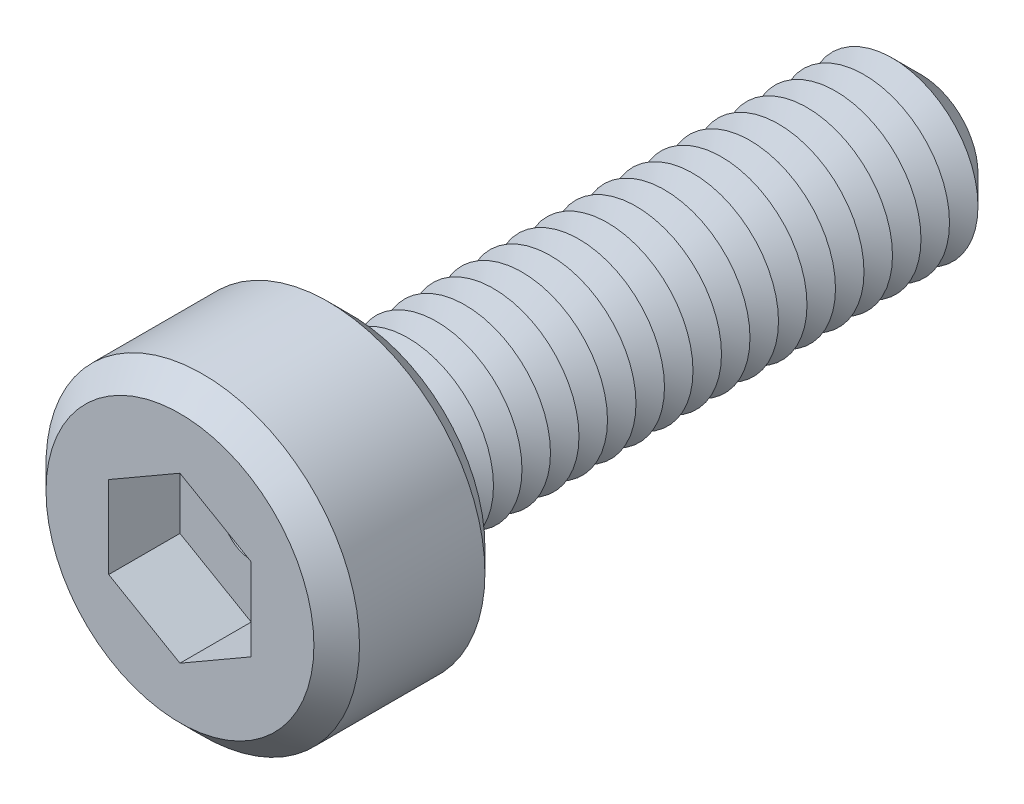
from build123d import *

# Parameters (mm, degrees)
SKETCH1_R           = 2.75
BOSS_EXTRUDE1_DEPTH = 3
SKETCH2_R           = 1.5
BOSS_EXTRUDE2_DEPTH = 10
CHAMFER1_SIZE       = 0.5
LPATTERN1_COUNT     = 19
LPATTERN1_PITCH     = 0.5
CUT_EXTRUDE1_DEPTH  = 1.25
SKETCH6_R           = 0.5
CUT_EXTRUDE2_DEPTH  = 11.75
CHAMFER2_SIZE       = 0.4


with BuildPart() as part:
    # Sketch1 → Boss-Extrude1 (new body)
    with BuildSketch(Plane.XY):
        Circle(SKETCH1_R)
    extrude(amount=BOSS_EXTRUDE1_DEPTH)

    # Sketch2 → Boss-Extrude2 (add)
    with BuildSketch(Plane(origin=(0, 0, 0), x_dir=(-1, 0, 0), z_dir=(0, 0, -1))):
        Circle(SKETCH2_R)
    extrude(amount=BOSS_EXTRUDE2_DEPTH)

    # Chamfer1
    chamfer1_edges = [part.edges().sort_by_distance(p)[0] for p in [
        (1.5, 0, -10),
    ]]
    chamfer(chamfer1_edges, length=CHAMFER1_SIZE)

    # Sketch4 → Cut-Revolve1 (revolve, cut)
    with BuildSketch(Plane(origin=(0, 0, 0), x_dir=(0, 0, -1), z_dir=(1, 0, 0)), mode=Mode.PRIVATE) as cut_revolve1_sk:
        Polygon((0, 1.5), (0.25, 1.066987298), (0.5, 1.5), align=None)
    cut_revolve1 = revolve(cut_revolve1_sk.sketch.rotate(Axis((0, 0, 2.512122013), (0, 0, -1)), 90), axis=Axis((0, 0, 2.512122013), (0, 0, -1)), mode=Mode.SUBTRACT)

    # LPattern1: Cut-Revolve1 ×19
    with Locations(*[(0, 0, -i * LPATTERN1_PITCH) for i in range(1, LPATTERN1_COUNT)]):
        add(cut_revolve1, mode=Mode.SUBTRACT)

    # Sketch5 → Cut-Extrude1 (cut)
    with BuildSketch(Plane.XY.offset(3)):
        Polygon((0, 1.443375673), (-1.25, 0.721687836), (-1.25, -0.721687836), (0, -1.443375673), (1.25, -0.721687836), (1.25, 0.721687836), align=None)
    extrude(amount=-CUT_EXTRUDE1_DEPTH, mode=Mode.SUBTRACT)

    # Sketch6 → Cut-Extrude2 (cut)
    with BuildSketch(Plane.XY.offset(1.75)):
        Circle(SKETCH6_R)
    extrude(amount=-CUT_EXTRUDE2_DEPTH, mode=Mode.SUBTRACT)

    # Chamfer2
    chamfer2_edges = [part.edges().sort_by_distance(p)[0] for p in [
        (-2.75, 0, 0),
        (-2.75, 0, 3),
    ]]
    chamfer(chamfer2_edges, length=CHAMFER2_SIZE)


solid = part.part
